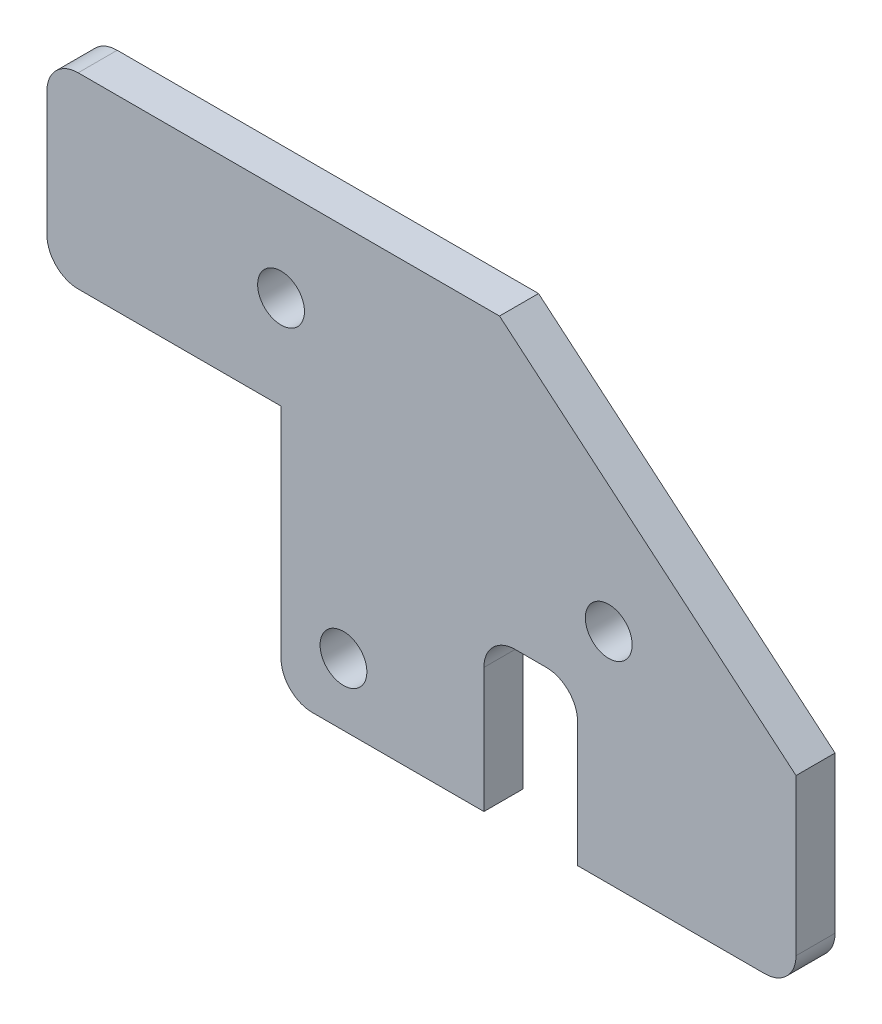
ISO-10303-21;
HEADER;
FILE_DESCRIPTION(('STEP AP214'),'2;1');
FILE_NAME('part.step','',(''),(''),'','','');
FILE_SCHEMA(('AUTOMOTIVE_DESIGN { 1 0 10303 214 1 1 1 1 }'));
ENDSEC;
DATA;
#1=APPLICATION_CONTEXT('core data for automotive mechanical design processes');
#2=APPLICATION_PROTOCOL_DEFINITION('international standard','automotive_design',2000,#1);
#3=PRODUCT_CONTEXT('',#1,'mechanical');
#4=PRODUCT('Part','Part','',(#3));
#5=PRODUCT_RELATED_PRODUCT_CATEGORY('part','',(#4));
#6=PRODUCT_DEFINITION_FORMATION('','',#4);
#7=PRODUCT_DEFINITION_CONTEXT('part definition',#1,'design');
#8=PRODUCT_DEFINITION('design','',#6,#7);
#9=PRODUCT_DEFINITION_SHAPE('','',#8);
#10=(LENGTH_UNIT() NAMED_UNIT(*) SI_UNIT(.MILLI.,.METRE.));
#11=(NAMED_UNIT(*) PLANE_ANGLE_UNIT() SI_UNIT($,.RADIAN.));
#12=(NAMED_UNIT(*) SI_UNIT($,.STERADIAN.) SOLID_ANGLE_UNIT());
#13=UNCERTAINTY_MEASURE_WITH_UNIT(LENGTH_MEASURE(1.E-05),#10,'distance_accuracy_value','');
#14=(GEOMETRIC_REPRESENTATION_CONTEXT(3) GLOBAL_UNCERTAINTY_ASSIGNED_CONTEXT((#13)) GLOBAL_UNIT_ASSIGNED_CONTEXT((#10,
#11,#12)) REPRESENTATION_CONTEXT('',''));
#15=CARTESIAN_POINT('',(0.,0.,0.));
#16=DIRECTION('',(0.,0.,1.));
#17=DIRECTION('',(1.,0.,0.));
#18=AXIS2_PLACEMENT_3D('',#15,#16,#17);
#19=CARTESIAN_POINT('',(-15.,6.,2.5));
#20=DIRECTION('',(0.,0.,-1.));
#21=DIRECTION('',(-1.,0.,0.));
#22=AXIS2_PLACEMENT_3D('',#19,#20,#21);
#23=PLANE('',#22);
#24=CARTESIAN_POINT('',(4.,-18.,2.5));
#25=DIRECTION('',(0.,0.,1.));
#26=DIRECTION('',(1.,0.,0.));
#27=AXIS2_PLACEMENT_3D('',#24,#25,#26);
#28=CIRCLE('',#27,1.5);
#29=CARTESIAN_POINT('',(5.50000000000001,-18.,2.5));
#30=VERTEX_POINT('',#29);
#31=EDGE_CURVE('E342',#30,#30,#28,.T.);
#32=ORIENTED_EDGE('',*,*,#31,.F.);
#33=EDGE_LOOP('',(#32));
#34=FACE_BOUND('',#33,.T.);
#35=DIRECTION('',(0.,-1.,0.));
#36=VECTOR('',#35,1.);
#37=CARTESIAN_POINT('',(0.,-22.,2.5));
#38=LINE('',#37,#36);
#39=CARTESIAN_POINT('',(0.,-5.99999999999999,2.5));
#40=VERTEX_POINT('',#39);
#41=CARTESIAN_POINT('',(0.,-20.,2.5));
#42=VERTEX_POINT('',#41);
#43=EDGE_CURVE('E174',#40,#42,#38,.T.);
#44=ORIENTED_EDGE('',*,*,#43,.T.);
#45=CARTESIAN_POINT('',(2.,-20.,2.5));
#46=DIRECTION('',(0.,0.,-1.));
#47=DIRECTION('',(-1.,0.,0.));
#48=AXIS2_PLACEMENT_3D('',#45,#46,#47);
#49=CIRCLE('',#48,2.);
#50=CARTESIAN_POINT('',(2.,-22.,2.5));
#51=VERTEX_POINT('',#50);
#52=EDGE_CURVE('E265',#42,#51,#49,.F.);
#53=ORIENTED_EDGE('',*,*,#52,.T.);
#54=DIRECTION('',(1.,0.,0.));
#55=VECTOR('',#54,1.);
#56=CARTESIAN_POINT('',(13.,-22.,2.5));
#57=LINE('',#56,#55);
#58=CARTESIAN_POINT('',(13.,-22.,2.5));
#59=VERTEX_POINT('',#58);
#60=EDGE_CURVE('E210',#51,#59,#57,.T.);
#61=ORIENTED_EDGE('',*,*,#60,.T.);
#62=DIRECTION('',(0.,1.,0.));
#63=VECTOR('',#62,1.);
#64=CARTESIAN_POINT('',(13.,-12.,2.5));
#65=LINE('',#64,#63);
#66=CARTESIAN_POINT('',(13.,-14.,2.5));
#67=VERTEX_POINT('',#66);
#68=EDGE_CURVE('E212',#59,#67,#65,.T.);
#69=ORIENTED_EDGE('',*,*,#68,.T.);
#70=CARTESIAN_POINT('',(15.,-14.,2.5));
#71=DIRECTION('',(0.,0.,-1.));
#72=DIRECTION('',(-1.,0.,0.));
#73=AXIS2_PLACEMENT_3D('',#70,#71,#72);
#74=CIRCLE('',#73,2.);
#75=CARTESIAN_POINT('',(15.,-12.,2.5));
#76=VERTEX_POINT('',#75);
#77=EDGE_CURVE('E11',#67,#76,#74,.T.);
#78=ORIENTED_EDGE('',*,*,#77,.T.);
#79=DIRECTION('',(1.,0.,0.));
#80=VECTOR('',#79,1.);
#81=CARTESIAN_POINT('',(19.,-12.,2.5));
#82=LINE('',#81,#80);
#83=CARTESIAN_POINT('',(17.,-12.,2.5));
#84=VERTEX_POINT('',#83);
#85=EDGE_CURVE('E215',#76,#84,#82,.T.);
#86=ORIENTED_EDGE('',*,*,#85,.T.);
#87=CARTESIAN_POINT('',(17.,-14.,2.5));
#88=DIRECTION('',(0.,0.,-1.));
#89=DIRECTION('',(-1.,0.,0.));
#90=AXIS2_PLACEMENT_3D('',#87,#88,#89);
#91=CIRCLE('',#90,2.);
#92=CARTESIAN_POINT('',(19.,-14.,2.5));
#93=VERTEX_POINT('',#92);
#94=EDGE_CURVE('E281',#84,#93,#91,.T.);
#95=ORIENTED_EDGE('',*,*,#94,.T.);
#96=DIRECTION('',(0.,-1.,0.));
#97=VECTOR('',#96,1.);
#98=CARTESIAN_POINT('',(19.,-22.,2.5));
#99=LINE('',#98,#97);
#100=CARTESIAN_POINT('',(19.,-22.,2.5));
#101=VERTEX_POINT('',#100);
#102=EDGE_CURVE('E218',#93,#101,#99,.T.);
#103=ORIENTED_EDGE('',*,*,#102,.T.);
#104=DIRECTION('',(1.,0.,0.));
#105=VECTOR('',#104,1.);
#106=CARTESIAN_POINT('',(33.,-22.,2.5));
#107=LINE('',#106,#105);
#108=CARTESIAN_POINT('',(31.,-22.,2.5));
#109=VERTEX_POINT('',#108);
#110=EDGE_CURVE('E220',#101,#109,#107,.T.);
#111=ORIENTED_EDGE('',*,*,#110,.T.);
#112=CARTESIAN_POINT('',(31.,-20.,2.5));
#113=DIRECTION('',(0.,0.,-1.));
#114=DIRECTION('',(-1.,0.,0.));
#115=AXIS2_PLACEMENT_3D('',#112,#113,#114);
#116=CIRCLE('',#115,2.);
#117=CARTESIAN_POINT('',(33.,-20.,2.5));
#118=VERTEX_POINT('',#117);
#119=EDGE_CURVE('E57',#109,#118,#116,.F.);
#120=ORIENTED_EDGE('',*,*,#119,.T.);
#121=DIRECTION('',(0.,1.,0.));
#122=VECTOR('',#121,1.);
#123=CARTESIAN_POINT('',(33.,-10.,2.5));
#124=LINE('',#123,#122);
#125=CARTESIAN_POINT('',(33.,-10.,2.5));
#126=VERTEX_POINT('',#125);
#127=EDGE_CURVE('E222',#118,#126,#124,.T.);
#128=ORIENTED_EDGE('',*,*,#127,.T.);
#129=DIRECTION('',(-0.764911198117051,0.64413574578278,0.));
#130=VECTOR('',#129,1.);
#131=CARTESIAN_POINT('',(14.,6.,2.5));
#132=LINE('',#131,#130);
#133=CARTESIAN_POINT('',(14.,6.,2.5));
#134=VERTEX_POINT('',#133);
#135=EDGE_CURVE('E224',#126,#134,#132,.T.);
#136=ORIENTED_EDGE('',*,*,#135,.T.);
#137=DIRECTION('',(-1.,0.,0.));
#138=VECTOR('',#137,1.);
#139=CARTESIAN_POINT('',(-15.,6.,2.5));
#140=LINE('',#139,#138);
#141=CARTESIAN_POINT('',(-13.,6.,2.5));
#142=VERTEX_POINT('',#141);
#143=EDGE_CURVE('E226',#134,#142,#140,.T.);
#144=ORIENTED_EDGE('',*,*,#143,.T.);
#145=CARTESIAN_POINT('',(-13.,4.,2.5));
#146=DIRECTION('',(0.,0.,-1.));
#147=DIRECTION('',(-1.,0.,0.));
#148=AXIS2_PLACEMENT_3D('',#145,#146,#147);
#149=CIRCLE('',#148,2.);
#150=CARTESIAN_POINT('',(-15.,4.,2.5));
#151=VERTEX_POINT('',#150);
#152=EDGE_CURVE('E260',#142,#151,#149,.F.);
#153=ORIENTED_EDGE('',*,*,#152,.T.);
#154=DIRECTION('',(0.,-1.,0.));
#155=VECTOR('',#154,1.);
#156=CARTESIAN_POINT('',(-15.,-6.,2.5));
#157=LINE('',#156,#155);
#158=CARTESIAN_POINT('',(-15.,-4.,2.5));
#159=VERTEX_POINT('',#158);
#160=EDGE_CURVE('E204',#151,#159,#157,.T.);
#161=ORIENTED_EDGE('',*,*,#160,.T.);
#162=CARTESIAN_POINT('',(-13.,-4.,2.5));
#163=DIRECTION('',(0.,0.,-1.));
#164=DIRECTION('',(-1.,0.,0.));
#165=AXIS2_PLACEMENT_3D('',#162,#163,#164);
#166=CIRCLE('',#165,2.);
#167=CARTESIAN_POINT('',(-13.,-6.,2.5));
#168=VERTEX_POINT('',#167);
#169=EDGE_CURVE('E262',#159,#168,#166,.F.);
#170=ORIENTED_EDGE('',*,*,#169,.T.);
#171=DIRECTION('',(1.,0.,0.));
#172=VECTOR('',#171,1.);
#173=CARTESIAN_POINT('',(0.,-5.99999999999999,2.5));
#174=LINE('',#173,#172);
#175=EDGE_CURVE('E207',#168,#40,#174,.T.);
#176=ORIENTED_EDGE('',*,*,#175,.T.);
#177=EDGE_LOOP('',(#44,#53,#61,#69,#78,#86,#95,#103,#111,#120,#128,#136,#144,#153,#161,#170,#176));
#178=FACE_BOUND('',#177,.T.);
#179=CARTESIAN_POINT('',(0.,0.,2.5));
#180=DIRECTION('',(0.,0.,1.));
#181=DIRECTION('',(1.,0.,0.));
#182=AXIS2_PLACEMENT_3D('',#179,#180,#181);
#183=CIRCLE('',#182,1.5);
#184=CARTESIAN_POINT('',(1.5,0.,2.5));
#185=VERTEX_POINT('',#184);
#186=EDGE_CURVE('E335',#185,#185,#183,.T.);
#187=ORIENTED_EDGE('',*,*,#186,.F.);
#188=EDGE_LOOP('',(#187));
#189=FACE_BOUND('',#188,.T.);
#190=CARTESIAN_POINT('',(21.,-8.,2.5));
#191=DIRECTION('',(0.,0.,1.));
#192=DIRECTION('',(1.,0.,0.));
#193=AXIS2_PLACEMENT_3D('',#190,#191,#192);
#194=CIRCLE('',#193,1.5);
#195=CARTESIAN_POINT('',(22.5,-8.,2.5));
#196=VERTEX_POINT('',#195);
#197=EDGE_CURVE('E348',#196,#196,#194,.T.);
#198=ORIENTED_EDGE('',*,*,#197,.F.);
#199=EDGE_LOOP('',(#198));
#200=FACE_BOUND('',#199,.T.);
#201=ADVANCED_FACE('F34',(#34,#178,#189,#200),#23,.F.);
#202=CARTESIAN_POINT('',(-15.,6.,0.));
#203=DIRECTION('',(0.,0.,-1.));
#204=DIRECTION('',(-1.,0.,0.));
#205=AXIS2_PLACEMENT_3D('',#202,#203,#204);
#206=PLANE('',#205);
#207=CARTESIAN_POINT('',(4.,-18.,0.));
#208=DIRECTION('',(0.,0.,1.));
#209=DIRECTION('',(1.,0.,0.));
#210=AXIS2_PLACEMENT_3D('',#207,#208,#209);
#211=CIRCLE('',#210,1.5);
#212=CARTESIAN_POINT('',(5.50000000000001,-18.,0.));
#213=VERTEX_POINT('',#212);
#214=EDGE_CURVE('E345',#213,#213,#211,.T.);
#215=ORIENTED_EDGE('',*,*,#214,.T.);
#216=EDGE_LOOP('',(#215));
#217=FACE_BOUND('',#216,.T.);
#218=DIRECTION('',(1.,0.,0.));
#219=VECTOR('',#218,1.);
#220=CARTESIAN_POINT('',(13.,-22.,0.));
#221=LINE('',#220,#219);
#222=CARTESIAN_POINT('',(2.,-22.,0.));
#223=VERTEX_POINT('',#222);
#224=CARTESIAN_POINT('',(13.,-22.,0.));
#225=VERTEX_POINT('',#224);
#226=EDGE_CURVE('E182',#223,#225,#221,.T.);
#227=ORIENTED_EDGE('',*,*,#226,.F.);
#228=CARTESIAN_POINT('',(2.,-20.,0.));
#229=DIRECTION('',(0.,0.,-1.));
#230=DIRECTION('',(-1.,0.,0.));
#231=AXIS2_PLACEMENT_3D('',#228,#229,#230);
#232=CIRCLE('',#231,2.);
#233=CARTESIAN_POINT('',(0.,-20.,0.));
#234=VERTEX_POINT('',#233);
#235=EDGE_CURVE('E181',#223,#234,#232,.T.);
#236=ORIENTED_EDGE('',*,*,#235,.T.);
#237=DIRECTION('',(0.,-1.,0.));
#238=VECTOR('',#237,1.);
#239=CARTESIAN_POINT('',(0.,-22.,0.));
#240=LINE('',#239,#238);
#241=CARTESIAN_POINT('',(0.,-5.99999999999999,0.));
#242=VERTEX_POINT('',#241);
#243=EDGE_CURVE('E166',#242,#234,#240,.T.);
#244=ORIENTED_EDGE('',*,*,#243,.F.);
#245=DIRECTION('',(1.,0.,0.));
#246=VECTOR('',#245,1.);
#247=CARTESIAN_POINT('',(0.,-5.99999999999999,0.));
#248=LINE('',#247,#246);
#249=CARTESIAN_POINT('',(-13.,-6.,0.));
#250=VERTEX_POINT('',#249);
#251=EDGE_CURVE('E156',#250,#242,#248,.T.);
#252=ORIENTED_EDGE('',*,*,#251,.F.);
#253=CARTESIAN_POINT('',(-13.,-4.,0.));
#254=DIRECTION('',(0.,0.,-1.));
#255=DIRECTION('',(-1.,0.,0.));
#256=AXIS2_PLACEMENT_3D('',#253,#254,#255);
#257=CIRCLE('',#256,2.);
#258=CARTESIAN_POINT('',(-15.,-4.,0.));
#259=VERTEX_POINT('',#258);
#260=EDGE_CURVE('E253',#250,#259,#257,.T.);
#261=ORIENTED_EDGE('',*,*,#260,.T.);
#262=DIRECTION('',(0.,-1.,0.));
#263=VECTOR('',#262,1.);
#264=CARTESIAN_POINT('',(-15.,-6.,0.));
#265=LINE('',#264,#263);
#266=CARTESIAN_POINT('',(-15.,4.,0.));
#267=VERTEX_POINT('',#266);
#268=EDGE_CURVE('E167',#267,#259,#265,.T.);
#269=ORIENTED_EDGE('',*,*,#268,.F.);
#270=CARTESIAN_POINT('',(-13.,4.,0.));
#271=DIRECTION('',(0.,0.,-1.));
#272=DIRECTION('',(-1.,0.,0.));
#273=AXIS2_PLACEMENT_3D('',#270,#271,#272);
#274=CIRCLE('',#273,2.);
#275=CARTESIAN_POINT('',(-13.,6.,0.));
#276=VERTEX_POINT('',#275);
#277=EDGE_CURVE('E251',#267,#276,#274,.T.);
#278=ORIENTED_EDGE('',*,*,#277,.T.);
#279=DIRECTION('',(-1.,0.,0.));
#280=VECTOR('',#279,1.);
#281=CARTESIAN_POINT('',(-15.,6.,0.));
#282=LINE('',#281,#280);
#283=CARTESIAN_POINT('',(14.,6.,0.));
#284=VERTEX_POINT('',#283);
#285=EDGE_CURVE('E202',#284,#276,#282,.T.);
#286=ORIENTED_EDGE('',*,*,#285,.F.);
#287=DIRECTION('',(-0.764911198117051,0.64413574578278,0.));
#288=VECTOR('',#287,1.);
#289=CARTESIAN_POINT('',(14.,6.,0.));
#290=LINE('',#289,#288);
#291=CARTESIAN_POINT('',(33.,-10.,0.));
#292=VERTEX_POINT('',#291);
#293=EDGE_CURVE('E200',#292,#284,#290,.T.);
#294=ORIENTED_EDGE('',*,*,#293,.F.);
#295=DIRECTION('',(0.,1.,0.));
#296=VECTOR('',#295,1.);
#297=CARTESIAN_POINT('',(33.,-10.,0.));
#298=LINE('',#297,#296);
#299=CARTESIAN_POINT('',(33.,-20.,0.));
#300=VERTEX_POINT('',#299);
#301=EDGE_CURVE('E198',#300,#292,#298,.T.);
#302=ORIENTED_EDGE('',*,*,#301,.F.);
#303=CARTESIAN_POINT('',(31.,-20.,0.));
#304=DIRECTION('',(0.,0.,-1.));
#305=DIRECTION('',(-1.,0.,0.));
#306=AXIS2_PLACEMENT_3D('',#303,#304,#305);
#307=CIRCLE('',#306,2.);
#308=CARTESIAN_POINT('',(31.,-22.,0.));
#309=VERTEX_POINT('',#308);
#310=EDGE_CURVE('E255',#300,#309,#307,.T.);
#311=ORIENTED_EDGE('',*,*,#310,.T.);
#312=DIRECTION('',(1.,0.,0.));
#313=VECTOR('',#312,1.);
#314=CARTESIAN_POINT('',(33.,-22.,0.));
#315=LINE('',#314,#313);
#316=CARTESIAN_POINT('',(19.,-22.,0.));
#317=VERTEX_POINT('',#316);
#318=EDGE_CURVE('E195',#317,#309,#315,.T.);
#319=ORIENTED_EDGE('',*,*,#318,.F.);
#320=DIRECTION('',(0.,-1.,0.));
#321=VECTOR('',#320,1.);
#322=CARTESIAN_POINT('',(19.,-22.,0.));
#323=LINE('',#322,#321);
#324=CARTESIAN_POINT('',(19.,-14.,0.));
#325=VERTEX_POINT('',#324);
#326=EDGE_CURVE('E193',#325,#317,#323,.T.);
#327=ORIENTED_EDGE('',*,*,#326,.F.);
#328=CARTESIAN_POINT('',(17.,-14.,0.));
#329=DIRECTION('',(0.,0.,-1.));
#330=DIRECTION('',(-1.,0.,0.));
#331=AXIS2_PLACEMENT_3D('',#328,#329,#330);
#332=CIRCLE('',#331,2.);
#333=CARTESIAN_POINT('',(17.,-12.,0.));
#334=VERTEX_POINT('',#333);
#335=EDGE_CURVE('E279',#325,#334,#332,.F.);
#336=ORIENTED_EDGE('',*,*,#335,.T.);
#337=DIRECTION('',(1.,0.,0.));
#338=VECTOR('',#337,1.);
#339=CARTESIAN_POINT('',(19.,-12.,0.));
#340=LINE('',#339,#338);
#341=CARTESIAN_POINT('',(15.,-12.,0.));
#342=VERTEX_POINT('',#341);
#343=EDGE_CURVE('E190',#342,#334,#340,.T.);
#344=ORIENTED_EDGE('',*,*,#343,.F.);
#345=CARTESIAN_POINT('',(15.,-14.,0.));
#346=DIRECTION('',(0.,0.,-1.));
#347=DIRECTION('',(-1.,0.,0.));
#348=AXIS2_PLACEMENT_3D('',#345,#346,#347);
#349=CIRCLE('',#348,2.);
#350=CARTESIAN_POINT('',(13.,-14.,0.));
#351=VERTEX_POINT('',#350);
#352=EDGE_CURVE('E42',#342,#351,#349,.F.);
#353=ORIENTED_EDGE('',*,*,#352,.T.);
#354=DIRECTION('',(0.,1.,0.));
#355=VECTOR('',#354,1.);
#356=CARTESIAN_POINT('',(13.,-12.,0.));
#357=LINE('',#356,#355);
#358=EDGE_CURVE('E184',#225,#351,#357,.T.);
#359=ORIENTED_EDGE('',*,*,#358,.F.);
#360=EDGE_LOOP('',(#227,#236,#244,#252,#261,#269,#278,#286,#294,#302,#311,#319,#327,#336,#344,
#353,#359));
#361=FACE_BOUND('',#360,.T.);
#362=CARTESIAN_POINT('',(0.,0.,0.));
#363=DIRECTION('',(0.,0.,1.));
#364=DIRECTION('',(1.,0.,0.));
#365=AXIS2_PLACEMENT_3D('',#362,#363,#364);
#366=CIRCLE('',#365,1.5);
#367=CARTESIAN_POINT('',(1.5,0.,0.));
#368=VERTEX_POINT('',#367);
#369=EDGE_CURVE('E337',#368,#368,#366,.T.);
#370=ORIENTED_EDGE('',*,*,#369,.T.);
#371=EDGE_LOOP('',(#370));
#372=FACE_BOUND('',#371,.T.);
#373=CARTESIAN_POINT('',(21.,-8.,0.));
#374=DIRECTION('',(0.,0.,1.));
#375=DIRECTION('',(1.,0.,0.));
#376=AXIS2_PLACEMENT_3D('',#373,#374,#375);
#377=CIRCLE('',#376,1.5);
#378=CARTESIAN_POINT('',(22.5,-8.,0.));
#379=VERTEX_POINT('',#378);
#380=EDGE_CURVE('E351',#379,#379,#377,.T.);
#381=ORIENTED_EDGE('',*,*,#380,.T.);
#382=EDGE_LOOP('',(#381));
#383=FACE_BOUND('',#382,.T.);
#384=ADVANCED_FACE('F179',(#217,#361,#372,#383),#206,.T.);
#385=CARTESIAN_POINT('',(-15.,-6.,2.5));
#386=DIRECTION('',(1.,0.,0.));
#387=DIRECTION('',(0.,0.,-1.));
#388=AXIS2_PLACEMENT_3D('',#385,#386,#387);
#389=PLANE('',#388);
#390=ORIENTED_EDGE('',*,*,#268,.T.);
#391=DIRECTION('',(0.,0.,-1.));
#392=VECTOR('',#391,1.);
#393=CARTESIAN_POINT('',(-15.,-4.,2.5));
#394=LINE('',#393,#392);
#395=EDGE_CURVE('E276',#259,#159,#394,.F.);
#396=ORIENTED_EDGE('',*,*,#395,.T.);
#397=ORIENTED_EDGE('',*,*,#160,.F.);
#398=DIRECTION('',(0.,0.,-1.));
#399=VECTOR('',#398,1.);
#400=CARTESIAN_POINT('',(-15.,4.,2.5));
#401=LINE('',#400,#399);
#402=EDGE_CURVE('E273',#151,#267,#401,.T.);
#403=ORIENTED_EDGE('',*,*,#402,.T.);
#404=EDGE_LOOP('',(#390,#396,#397,#403));
#405=FACE_BOUND('',#404,.T.);
#406=ADVANCED_FACE('F36',(#405),#389,.F.);
#407=CARTESIAN_POINT('',(0.,-5.99999999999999,2.5));
#408=DIRECTION('',(0.,1.,0.));
#409=DIRECTION('',(-1.,0.,0.));
#410=AXIS2_PLACEMENT_3D('',#407,#408,#409);
#411=PLANE('',#410);
#412=ORIENTED_EDGE('',*,*,#175,.F.);
#413=DIRECTION('',(0.,0.,-1.));
#414=VECTOR('',#413,1.);
#415=CARTESIAN_POINT('',(-13.,-6.,2.5));
#416=LINE('',#415,#414);
#417=EDGE_CURVE('E163',#168,#250,#416,.T.);
#418=ORIENTED_EDGE('',*,*,#417,.T.);
#419=ORIENTED_EDGE('',*,*,#251,.T.);
#420=DIRECTION('',(0.,0.,-1.));
#421=VECTOR('',#420,1.);
#422=CARTESIAN_POINT('',(0.,-5.99999999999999,2.5));
#423=LINE('',#422,#421);
#424=EDGE_CURVE('E160',#40,#242,#423,.T.);
#425=ORIENTED_EDGE('',*,*,#424,.F.);
#426=EDGE_LOOP('',(#412,#418,#419,#425));
#427=FACE_BOUND('',#426,.T.);
#428=ADVANCED_FACE('F159',(#427),#411,.F.);
#429=CARTESIAN_POINT('',(0.,-22.,2.5));
#430=DIRECTION('',(1.,0.,0.));
#431=DIRECTION('',(0.,1.,0.));
#432=AXIS2_PLACEMENT_3D('',#429,#430,#431);
#433=PLANE('',#432);
#434=ORIENTED_EDGE('',*,*,#243,.T.);
#435=DIRECTION('',(0.,0.,-1.));
#436=VECTOR('',#435,1.);
#437=CARTESIAN_POINT('',(0.,-20.,2.5));
#438=LINE('',#437,#436);
#439=EDGE_CURVE('E258',#234,#42,#438,.F.);
#440=ORIENTED_EDGE('',*,*,#439,.T.);
#441=ORIENTED_EDGE('',*,*,#43,.F.);
#442=ORIENTED_EDGE('',*,*,#424,.T.);
#443=EDGE_LOOP('',(#434,#440,#441,#442));
#444=FACE_BOUND('',#443,.T.);
#445=ADVANCED_FACE('F171',(#444),#433,.F.);
#446=CARTESIAN_POINT('',(13.,-22.,2.5));
#447=DIRECTION('',(0.,1.,0.));
#448=DIRECTION('',(-1.,0.,0.));
#449=AXIS2_PLACEMENT_3D('',#446,#447,#448);
#450=PLANE('',#449);
#451=ORIENTED_EDGE('',*,*,#60,.F.);
#452=DIRECTION('',(0.,0.,-1.));
#453=VECTOR('',#452,1.);
#454=CARTESIAN_POINT('',(1.99999999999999,-22.,2.5));
#455=LINE('',#454,#453);
#456=EDGE_CURVE('E248',#51,#223,#455,.T.);
#457=ORIENTED_EDGE('',*,*,#456,.T.);
#458=ORIENTED_EDGE('',*,*,#226,.T.);
#459=DIRECTION('',(0.,0.,-1.));
#460=VECTOR('',#459,1.);
#461=CARTESIAN_POINT('',(13.,-22.,2.5));
#462=LINE('',#461,#460);
#463=EDGE_CURVE('E176',#59,#225,#462,.T.);
#464=ORIENTED_EDGE('',*,*,#463,.F.);
#465=EDGE_LOOP('',(#451,#457,#458,#464));
#466=FACE_BOUND('',#465,.T.);
#467=ADVANCED_FACE('F394',(#466),#450,.F.);
#468=CARTESIAN_POINT('',(13.,-12.,2.5));
#469=DIRECTION('',(-1.,0.,0.));
#470=DIRECTION('',(0.,-1.,0.));
#471=AXIS2_PLACEMENT_3D('',#468,#469,#470);
#472=PLANE('',#471);
#473=ORIENTED_EDGE('',*,*,#358,.T.);
#474=DIRECTION('',(0.,0.,-1.));
#475=VECTOR('',#474,1.);
#476=CARTESIAN_POINT('',(13.,-14.,2.5));
#477=LINE('',#476,#475);
#478=EDGE_CURVE('E246',#351,#67,#477,.F.);
#479=ORIENTED_EDGE('',*,*,#478,.T.);
#480=ORIENTED_EDGE('',*,*,#68,.F.);
#481=ORIENTED_EDGE('',*,*,#463,.T.);
#482=EDGE_LOOP('',(#473,#479,#480,#481));
#483=FACE_BOUND('',#482,.T.);
#484=ADVANCED_FACE('F288',(#483),#472,.F.);
#485=CARTESIAN_POINT('',(19.,-12.,2.5));
#486=DIRECTION('',(0.,1.,0.));
#487=DIRECTION('',(-1.,0.,0.));
#488=AXIS2_PLACEMENT_3D('',#485,#486,#487);
#489=PLANE('',#488);
#490=ORIENTED_EDGE('',*,*,#343,.T.);
#491=DIRECTION('',(0.,0.,-1.));
#492=VECTOR('',#491,1.);
#493=CARTESIAN_POINT('',(17.,-12.,2.5));
#494=LINE('',#493,#492);
#495=EDGE_CURVE('E244',#334,#84,#494,.F.);
#496=ORIENTED_EDGE('',*,*,#495,.T.);
#497=ORIENTED_EDGE('',*,*,#85,.F.);
#498=DIRECTION('',(0.,0.,-1.));
#499=VECTOR('',#498,1.);
#500=CARTESIAN_POINT('',(15.,-12.,0.));
#501=LINE('',#500,#499);
#502=EDGE_CURVE('E241',#76,#342,#501,.T.);
#503=ORIENTED_EDGE('',*,*,#502,.T.);
#504=EDGE_LOOP('',(#490,#496,#497,#503));
#505=FACE_BOUND('',#504,.T.);
#506=ADVANCED_FACE('F297',(#505),#489,.F.);
#507=CARTESIAN_POINT('',(19.,-22.,2.5));
#508=DIRECTION('',(1.,0.,0.));
#509=DIRECTION('',(0.,1.,0.));
#510=AXIS2_PLACEMENT_3D('',#507,#508,#509);
#511=PLANE('',#510);
#512=ORIENTED_EDGE('',*,*,#102,.F.);
#513=DIRECTION('',(0.,0.,-1.));
#514=VECTOR('',#513,1.);
#515=CARTESIAN_POINT('',(19.,-14.,0.));
#516=LINE('',#515,#514);
#517=EDGE_CURVE('E175',#93,#325,#516,.T.);
#518=ORIENTED_EDGE('',*,*,#517,.T.);
#519=ORIENTED_EDGE('',*,*,#326,.T.);
#520=DIRECTION('',(0.,0.,-1.));
#521=VECTOR('',#520,1.);
#522=CARTESIAN_POINT('',(19.,-22.,2.5));
#523=LINE('',#522,#521);
#524=EDGE_CURVE('E234',#101,#317,#523,.T.);
#525=ORIENTED_EDGE('',*,*,#524,.F.);
#526=EDGE_LOOP('',(#512,#518,#519,#525));
#527=FACE_BOUND('',#526,.T.);
#528=ADVANCED_FACE('F305',(#527),#511,.F.);
#529=CARTESIAN_POINT('',(33.,-22.,2.5));
#530=DIRECTION('',(0.,1.,0.));
#531=DIRECTION('',(-1.,0.,0.));
#532=AXIS2_PLACEMENT_3D('',#529,#530,#531);
#533=PLANE('',#532);
#534=ORIENTED_EDGE('',*,*,#318,.T.);
#535=DIRECTION('',(0.,0.,-1.));
#536=VECTOR('',#535,1.);
#537=CARTESIAN_POINT('',(31.,-22.,2.5));
#538=LINE('',#537,#536);
#539=EDGE_CURVE('E270',#309,#109,#538,.F.);
#540=ORIENTED_EDGE('',*,*,#539,.T.);
#541=ORIENTED_EDGE('',*,*,#110,.F.);
#542=ORIENTED_EDGE('',*,*,#524,.T.);
#543=EDGE_LOOP('',(#534,#540,#541,#542));
#544=FACE_BOUND('',#543,.T.);
#545=ADVANCED_FACE('F310',(#544),#533,.F.);
#546=CARTESIAN_POINT('',(33.,-10.,2.5));
#547=DIRECTION('',(-1.,0.,0.));
#548=DIRECTION('',(0.,0.,1.));
#549=AXIS2_PLACEMENT_3D('',#546,#547,#548);
#550=PLANE('',#549);
#551=ORIENTED_EDGE('',*,*,#127,.F.);
#552=DIRECTION('',(0.,0.,-1.));
#553=VECTOR('',#552,1.);
#554=CARTESIAN_POINT('',(33.,-20.,2.5));
#555=LINE('',#554,#553);
#556=EDGE_CURVE('E267',#118,#300,#555,.T.);
#557=ORIENTED_EDGE('',*,*,#556,.T.);
#558=ORIENTED_EDGE('',*,*,#301,.T.);
#559=DIRECTION('',(0.,0.,-1.));
#560=VECTOR('',#559,1.);
#561=CARTESIAN_POINT('',(33.,-10.,2.5));
#562=LINE('',#561,#560);
#563=EDGE_CURVE('E231',#126,#292,#562,.T.);
#564=ORIENTED_EDGE('',*,*,#563,.F.);
#565=EDGE_LOOP('',(#551,#557,#558,#564));
#566=FACE_BOUND('',#565,.T.);
#567=ADVANCED_FACE('F317',(#566),#550,.F.);
#568=CARTESIAN_POINT('',(14.,6.,2.5));
#569=DIRECTION('',(-0.64413574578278,-0.764911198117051,0.));
#570=DIRECTION('',(0.764911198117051,-0.64413574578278,0.));
#571=AXIS2_PLACEMENT_3D('',#568,#569,#570);
#572=PLANE('',#571);
#573=ORIENTED_EDGE('',*,*,#293,.T.);
#574=DIRECTION('',(0.,0.,-1.));
#575=VECTOR('',#574,1.);
#576=CARTESIAN_POINT('',(14.,6.,2.5));
#577=LINE('',#576,#575);
#578=EDGE_CURVE('E228',#134,#284,#577,.T.);
#579=ORIENTED_EDGE('',*,*,#578,.F.);
#580=ORIENTED_EDGE('',*,*,#135,.F.);
#581=ORIENTED_EDGE('',*,*,#563,.T.);
#582=EDGE_LOOP('',(#573,#579,#580,#581));
#583=FACE_BOUND('',#582,.T.);
#584=ADVANCED_FACE('F323',(#583),#572,.F.);
#585=CARTESIAN_POINT('',(-15.,6.,2.5));
#586=DIRECTION('',(0.,-1.,0.));
#587=DIRECTION('',(0.,0.,-1.));
#588=AXIS2_PLACEMENT_3D('',#585,#586,#587);
#589=PLANE('',#588);
#590=ORIENTED_EDGE('',*,*,#285,.T.);
#591=DIRECTION('',(0.,0.,-1.));
#592=VECTOR('',#591,1.);
#593=CARTESIAN_POINT('',(-13.,6.,2.5));
#594=LINE('',#593,#592);
#595=EDGE_CURVE('E49',#276,#142,#594,.F.);
#596=ORIENTED_EDGE('',*,*,#595,.T.);
#597=ORIENTED_EDGE('',*,*,#143,.F.);
#598=ORIENTED_EDGE('',*,*,#578,.T.);
#599=EDGE_LOOP('',(#590,#596,#597,#598));
#600=FACE_BOUND('',#599,.T.);
#601=ADVANCED_FACE('F325',(#600),#589,.F.);
#602=CARTESIAN_POINT('',(0.,0.,2.5));
#603=DIRECTION('',(0.,0.,-1.));
#604=DIRECTION('',(-1.,0.,0.));
#605=AXIS2_PLACEMENT_3D('',#602,#603,#604);
#606=CYLINDRICAL_SURFACE('',#605,1.5);
#607=ORIENTED_EDGE('',*,*,#186,.T.);
#608=EDGE_LOOP('',(#607));
#609=FACE_BOUND('',#608,.T.);
#610=ORIENTED_EDGE('',*,*,#369,.F.);
#611=EDGE_LOOP('',(#610));
#612=FACE_BOUND('',#611,.T.);
#613=ADVANCED_FACE('F366',(#609,#612),#606,.F.);
#614=CARTESIAN_POINT('',(4.,-18.,2.5));
#615=DIRECTION('',(0.,0.,-1.));
#616=DIRECTION('',(-1.,0.,0.));
#617=AXIS2_PLACEMENT_3D('',#614,#615,#616);
#618=CYLINDRICAL_SURFACE('',#617,1.5);
#619=ORIENTED_EDGE('',*,*,#31,.T.);
#620=EDGE_LOOP('',(#619));
#621=FACE_BOUND('',#620,.T.);
#622=ORIENTED_EDGE('',*,*,#214,.F.);
#623=EDGE_LOOP('',(#622));
#624=FACE_BOUND('',#623,.T.);
#625=ADVANCED_FACE('F358',(#621,#624),#618,.F.);
#626=CARTESIAN_POINT('',(21.,-8.,2.5));
#627=DIRECTION('',(0.,0.,-1.));
#628=DIRECTION('',(-1.,0.,0.));
#629=AXIS2_PLACEMENT_3D('',#626,#627,#628);
#630=CYLINDRICAL_SURFACE('',#629,1.5);
#631=ORIENTED_EDGE('',*,*,#197,.T.);
#632=EDGE_LOOP('',(#631));
#633=FACE_BOUND('',#632,.T.);
#634=ORIENTED_EDGE('',*,*,#380,.F.);
#635=EDGE_LOOP('',(#634));
#636=FACE_BOUND('',#635,.T.);
#637=ADVANCED_FACE('F356',(#633,#636),#630,.F.);
#638=CARTESIAN_POINT('',(17.,-14.,2.5));
#639=DIRECTION('',(0.,0.,1.));
#640=DIRECTION('',(1.,0.,0.));
#641=AXIS2_PLACEMENT_3D('',#638,#639,#640);
#642=CYLINDRICAL_SURFACE('',#641,2.);
#643=ORIENTED_EDGE('',*,*,#94,.F.);
#644=ORIENTED_EDGE('',*,*,#495,.F.);
#645=ORIENTED_EDGE('',*,*,#335,.F.);
#646=ORIENTED_EDGE('',*,*,#517,.F.);
#647=EDGE_LOOP('',(#643,#644,#645,#646));
#648=FACE_BOUND('',#647,.T.);
#649=ADVANCED_FACE('F300',(#648),#642,.F.);
#650=CARTESIAN_POINT('',(15.,-14.,2.5));
#651=DIRECTION('',(0.,0.,1.));
#652=DIRECTION('',(1.,0.,0.));
#653=AXIS2_PLACEMENT_3D('',#650,#651,#652);
#654=CYLINDRICAL_SURFACE('',#653,2.);
#655=ORIENTED_EDGE('',*,*,#77,.F.);
#656=ORIENTED_EDGE('',*,*,#478,.F.);
#657=ORIENTED_EDGE('',*,*,#352,.F.);
#658=ORIENTED_EDGE('',*,*,#502,.F.);
#659=EDGE_LOOP('',(#655,#656,#657,#658));
#660=FACE_BOUND('',#659,.T.);
#661=ADVANCED_FACE('F292',(#660),#654,.F.);
#662=CARTESIAN_POINT('',(2.,-20.,2.5));
#663=DIRECTION('',(0.,0.,-1.));
#664=DIRECTION('',(-1.,0.,0.));
#665=AXIS2_PLACEMENT_3D('',#662,#663,#664);
#666=CYLINDRICAL_SURFACE('',#665,2.);
#667=ORIENTED_EDGE('',*,*,#52,.F.);
#668=ORIENTED_EDGE('',*,*,#439,.F.);
#669=ORIENTED_EDGE('',*,*,#235,.F.);
#670=ORIENTED_EDGE('',*,*,#456,.F.);
#671=EDGE_LOOP('',(#667,#668,#669,#670));
#672=FACE_BOUND('',#671,.T.);
#673=ADVANCED_FACE('F463',(#672),#666,.T.);
#674=CARTESIAN_POINT('',(31.,-20.,2.5));
#675=DIRECTION('',(0.,0.,-1.));
#676=DIRECTION('',(-1.,0.,0.));
#677=AXIS2_PLACEMENT_3D('',#674,#675,#676);
#678=CYLINDRICAL_SURFACE('',#677,2.);
#679=ORIENTED_EDGE('',*,*,#119,.F.);
#680=ORIENTED_EDGE('',*,*,#539,.F.);
#681=ORIENTED_EDGE('',*,*,#310,.F.);
#682=ORIENTED_EDGE('',*,*,#556,.F.);
#683=EDGE_LOOP('',(#679,#680,#681,#682));
#684=FACE_BOUND('',#683,.T.);
#685=ADVANCED_FACE('F314',(#684),#678,.T.);
#686=CARTESIAN_POINT('',(-13.,-4.,2.5));
#687=DIRECTION('',(0.,0.,-1.));
#688=DIRECTION('',(-1.,0.,0.));
#689=AXIS2_PLACEMENT_3D('',#686,#687,#688);
#690=CYLINDRICAL_SURFACE('',#689,2.);
#691=ORIENTED_EDGE('',*,*,#169,.F.);
#692=ORIENTED_EDGE('',*,*,#395,.F.);
#693=ORIENTED_EDGE('',*,*,#260,.F.);
#694=ORIENTED_EDGE('',*,*,#417,.F.);
#695=EDGE_LOOP('',(#691,#692,#693,#694));
#696=FACE_BOUND('',#695,.T.);
#697=ADVANCED_FACE('F481',(#696),#690,.T.);
#698=CARTESIAN_POINT('',(-13.,4.,2.5));
#699=DIRECTION('',(0.,0.,-1.));
#700=DIRECTION('',(-1.,0.,0.));
#701=AXIS2_PLACEMENT_3D('',#698,#699,#700);
#702=CYLINDRICAL_SURFACE('',#701,2.);
#703=ORIENTED_EDGE('',*,*,#152,.F.);
#704=ORIENTED_EDGE('',*,*,#595,.F.);
#705=ORIENTED_EDGE('',*,*,#277,.F.);
#706=ORIENTED_EDGE('',*,*,#402,.F.);
#707=EDGE_LOOP('',(#703,#704,#705,#706));
#708=FACE_BOUND('',#707,.T.);
#709=ADVANCED_FACE('F330',(#708),#702,.T.);
#710=CLOSED_SHELL('',(#201,#384,#406,#428,#445,#467,#484,#506,#528,#545,#567,#584,#601,#613,
#625,#637,#649,#661,#673,#685,#697,#709));
#711=MANIFOLD_SOLID_BREP('B2',#710);
#712=ADVANCED_BREP_SHAPE_REPRESENTATION('',(#18,#711),#14);
#713=SHAPE_DEFINITION_REPRESENTATION(#9,#712);
ENDSEC;
END-ISO-10303-21;
